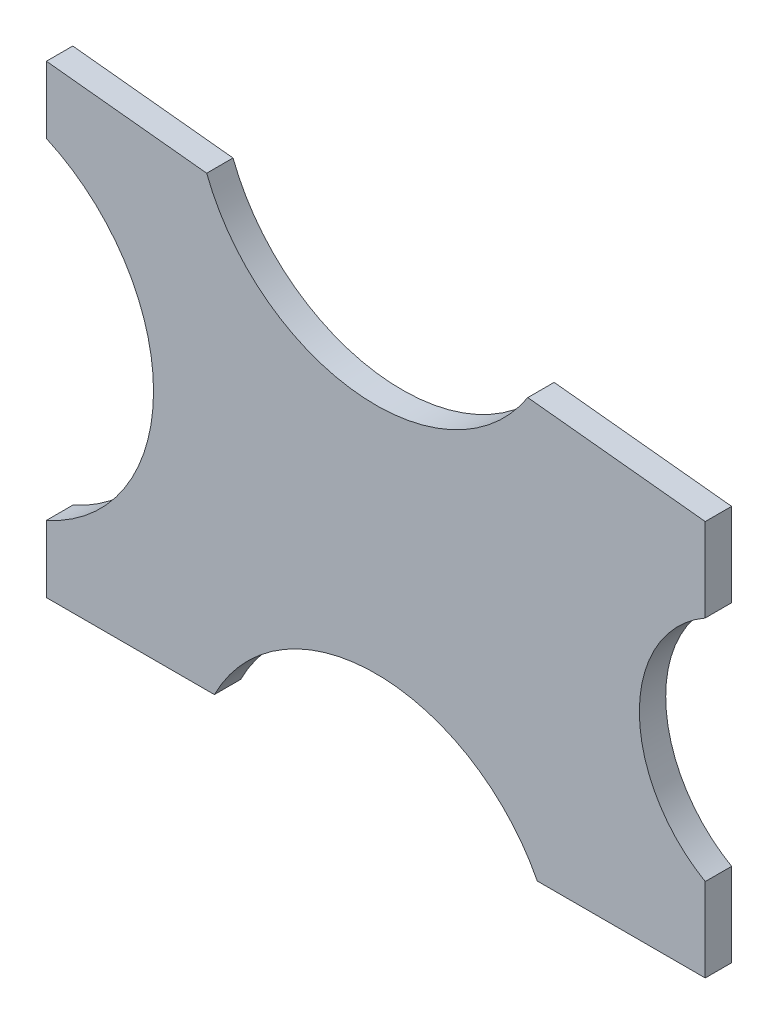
from build123d import *

# Parameters (mm, degrees)
BOSS_EXTRUDE1_DEPTH = 2.54


with BuildPart() as part:
    # Sketch2 → Boss-Extrude1 (new body)
    with BuildSketch(Plane.XY):
        with BuildLine():
            Line((-63.5, 0), (-47.310734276, 0))
            ThreePointArc((-47.310734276, 0), (-31.75, 9.5377), (-16.189265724, 0))
            Line((-16.189265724, 0), (0, 0))
            Line((0, 0), (0, 8.051477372))
            ThreePointArc((0, 8.051477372), (-6.35, 19.05), (0, 30.048522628))
            Line((0, 30.048522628), (0, 38.1))
            Line((0, 38.1), (-17.10287622, 39.897584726))
            ThreePointArc((-17.10287622, 39.897584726), (-33.57532829, 32.038672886), (-48.053858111, 43.150664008))
            Line((-48.053858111, 43.150664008), (-63.5, 44.774118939))
            Line((-63.5, 44.774118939), (-63.5, 38.32432484))
            ThreePointArc((-63.5, 38.32432484), (-53.1749, 22.38705947), (-63.5, 6.449794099))
            Line((-63.5, 6.449794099), (-63.5, 0))
        make_face()
    extrude(amount=BOSS_EXTRUDE1_DEPTH)


solid = part.part
